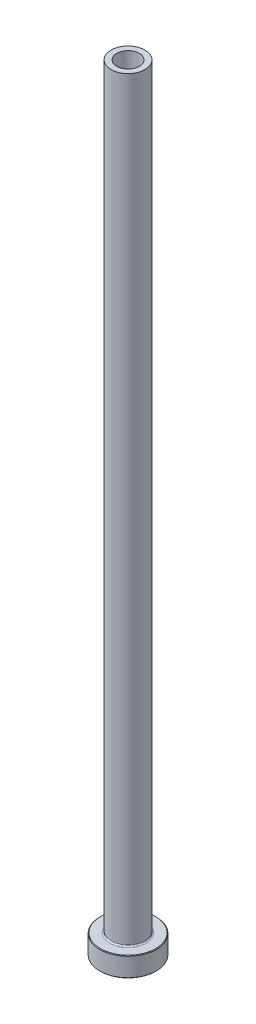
ISO-10303-21;
HEADER;
FILE_DESCRIPTION(('STEP AP214'),'2;1');
FILE_NAME('part.step','',(''),(''),'','','');
FILE_SCHEMA(('AUTOMOTIVE_DESIGN { 1 0 10303 214 1 1 1 1 }'));
ENDSEC;
DATA;
#1=APPLICATION_CONTEXT('core data for automotive mechanical design processes');
#2=APPLICATION_PROTOCOL_DEFINITION('international standard','automotive_design',2000,#1);
#3=PRODUCT_CONTEXT('',#1,'mechanical');
#4=PRODUCT('Part','Part','',(#3));
#5=PRODUCT_RELATED_PRODUCT_CATEGORY('part','',(#4));
#6=PRODUCT_DEFINITION_FORMATION('','',#4);
#7=PRODUCT_DEFINITION_CONTEXT('part definition',#1,'design');
#8=PRODUCT_DEFINITION('design','',#6,#7);
#9=PRODUCT_DEFINITION_SHAPE('','',#8);
#10=(LENGTH_UNIT() NAMED_UNIT(*) SI_UNIT(.MILLI.,.METRE.));
#11=(NAMED_UNIT(*) PLANE_ANGLE_UNIT() SI_UNIT($,.RADIAN.));
#12=(NAMED_UNIT(*) SI_UNIT($,.STERADIAN.) SOLID_ANGLE_UNIT());
#13=UNCERTAINTY_MEASURE_WITH_UNIT(LENGTH_MEASURE(1.E-05),#10,'distance_accuracy_value','');
#14=(GEOMETRIC_REPRESENTATION_CONTEXT(3) GLOBAL_UNCERTAINTY_ASSIGNED_CONTEXT((#13)) GLOBAL_UNIT_ASSIGNED_CONTEXT((#10,
#11,#12)) REPRESENTATION_CONTEXT('',''));
#15=CARTESIAN_POINT('',(0.,0.,0.));
#16=DIRECTION('',(0.,0.,1.));
#17=DIRECTION('',(1.,0.,0.));
#18=AXIS2_PLACEMENT_3D('',#15,#16,#17);
#19=CARTESIAN_POINT('',(0.,92.1876809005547,0.));
#20=DIRECTION('',(0.,1.,0.));
#21=DIRECTION('',(0.,0.,1.));
#22=AXIS2_PLACEMENT_3D('',#19,#20,#21);
#23=CYLINDRICAL_SURFACE('',#22,4.00000000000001);
#24=CARTESIAN_POINT('',(0.,275.,0.));
#25=DIRECTION('',(0.,1.,0.));
#26=DIRECTION('',(0.,0.,1.));
#27=AXIS2_PLACEMENT_3D('',#24,#25,#26);
#28=CIRCLE('',#27,4.00000000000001);
#29=CARTESIAN_POINT('',(0.,275.,4.00000000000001));
#30=VERTEX_POINT('',#29);
#31=EDGE_CURVE('E62',#30,#30,#28,.T.);
#32=ORIENTED_EDGE('',*,*,#31,.T.);
#33=EDGE_LOOP('',(#32));
#34=FACE_BOUND('',#33,.T.);
#35=CARTESIAN_POINT('',(0.,230.,0.));
#36=DIRECTION('',(0.,1.,0.));
#37=DIRECTION('',(0.,0.,1.));
#38=AXIS2_PLACEMENT_3D('',#35,#36,#37);
#39=CIRCLE('',#38,4.00000000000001);
#40=CARTESIAN_POINT('',(0.,230.,4.00000000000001));
#41=VERTEX_POINT('',#40);
#42=EDGE_CURVE('E71',#41,#41,#39,.T.);
#43=ORIENTED_EDGE('',*,*,#42,.F.);
#44=EDGE_LOOP('',(#43));
#45=FACE_BOUND('',#44,.T.);
#46=ADVANCED_FACE('F30',(#34,#45),#23,.F.);
#47=CARTESIAN_POINT('',(-4.00000000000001,275.,0.));
#48=DIRECTION('',(0.,1.,0.));
#49=DIRECTION('',(0.,0.,1.));
#50=AXIS2_PLACEMENT_3D('',#47,#48,#49);
#51=PLANE('',#50);
#52=CARTESIAN_POINT('',(0.,275.,0.));
#53=DIRECTION('',(0.,1.,0.));
#54=DIRECTION('',(0.,0.,1.));
#55=AXIS2_PLACEMENT_3D('',#52,#53,#54);
#56=CIRCLE('',#55,6.00000000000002);
#57=CARTESIAN_POINT('',(0.,275.,6.00000000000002));
#58=VERTEX_POINT('',#57);
#59=EDGE_CURVE('E65',#58,#58,#56,.T.);
#60=ORIENTED_EDGE('',*,*,#59,.T.);
#61=EDGE_LOOP('',(#60));
#62=FACE_BOUND('',#61,.T.);
#63=ORIENTED_EDGE('',*,*,#31,.F.);
#64=EDGE_LOOP('',(#63));
#65=FACE_BOUND('',#64,.T.);
#66=ADVANCED_FACE('F79',(#62,#65),#51,.T.);
#67=CARTESIAN_POINT('',(0.,92.1876809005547,0.));
#68=DIRECTION('',(0.,1.,0.));
#69=DIRECTION('',(0.,0.,1.));
#70=AXIS2_PLACEMENT_3D('',#67,#68,#69);
#71=CYLINDRICAL_SURFACE('',#70,6.00000000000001);
#72=CARTESIAN_POINT('',(0.,7.50000000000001,0.));
#73=DIRECTION('',(0.,1.,0.));
#74=DIRECTION('',(0.,0.,1.));
#75=AXIS2_PLACEMENT_3D('',#72,#73,#74);
#76=CIRCLE('',#75,6.00000000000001);
#77=CARTESIAN_POINT('',(0.,7.50000000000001,6.00000000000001));
#78=VERTEX_POINT('',#77);
#79=EDGE_CURVE('E59',#78,#78,#76,.T.);
#80=ORIENTED_EDGE('',*,*,#79,.T.);
#81=EDGE_LOOP('',(#80));
#82=FACE_BOUND('',#81,.T.);
#83=ORIENTED_EDGE('',*,*,#59,.F.);
#84=EDGE_LOOP('',(#83));
#85=FACE_BOUND('',#84,.T.);
#86=ADVANCED_FACE('F85',(#82,#85),#71,.T.);
#87=CARTESIAN_POINT('',(-5.99999999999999,7.,0.));
#88=DIRECTION('',(0.,1.,0.));
#89=DIRECTION('',(0.,0.,1.));
#90=AXIS2_PLACEMENT_3D('',#87,#88,#89);
#91=PLANE('',#90);
#92=CARTESIAN_POINT('',(0.,7.,0.));
#93=DIRECTION('',(0.,1.,0.));
#94=DIRECTION('',(0.,0.,1.));
#95=AXIS2_PLACEMENT_3D('',#92,#93,#94);
#96=CIRCLE('',#95,9.80000000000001);
#97=CARTESIAN_POINT('',(0.,7.,-9.80000000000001));
#98=VERTEX_POINT('',#97);
#99=EDGE_CURVE('E53',#98,#98,#96,.T.);
#100=ORIENTED_EDGE('',*,*,#99,.T.);
#101=EDGE_LOOP('',(#100));
#102=FACE_BOUND('',#101,.T.);
#103=CARTESIAN_POINT('',(0.,7.,0.));
#104=DIRECTION('',(0.,1.,0.));
#105=DIRECTION('',(0.,0.,1.));
#106=AXIS2_PLACEMENT_3D('',#103,#104,#105);
#107=CIRCLE('',#106,6.50000000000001);
#108=CARTESIAN_POINT('',(0.,7.,6.50000000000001));
#109=VERTEX_POINT('',#108);
#110=EDGE_CURVE('E56',#109,#109,#107,.F.);
#111=ORIENTED_EDGE('',*,*,#110,.T.);
#112=EDGE_LOOP('',(#111));
#113=FACE_BOUND('',#112,.T.);
#114=ADVANCED_FACE('F111',(#102,#113),#91,.T.);
#115=CARTESIAN_POINT('',(0.,92.1876809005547,0.));
#116=DIRECTION('',(0.,1.,0.));
#117=DIRECTION('',(0.,0.,1.));
#118=AXIS2_PLACEMENT_3D('',#115,#116,#117);
#119=CYLINDRICAL_SURFACE('',#118,9.99999999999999);
#120=CARTESIAN_POINT('',(0.,6.80000000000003,0.));
#121=DIRECTION('',(0.,1.,0.));
#122=DIRECTION('',(0.,0.,1.));
#123=AXIS2_PLACEMENT_3D('',#120,#121,#122);
#124=CIRCLE('',#123,9.99999999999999);
#125=CARTESIAN_POINT('',(0.,6.80000000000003,-9.99999999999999));
#126=VERTEX_POINT('',#125);
#127=EDGE_CURVE('E45',#126,#126,#124,.F.);
#128=ORIENTED_EDGE('',*,*,#127,.T.);
#129=EDGE_LOOP('',(#128));
#130=FACE_BOUND('',#129,.T.);
#131=CARTESIAN_POINT('',(0.,0.200000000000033,0.));
#132=DIRECTION('',(0.,-1.,0.));
#133=DIRECTION('',(0.,0.,-1.));
#134=AXIS2_PLACEMENT_3D('',#131,#132,#133);
#135=CIRCLE('',#134,9.99999999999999);
#136=CARTESIAN_POINT('',(0.,0.200000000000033,-9.99999999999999));
#137=VERTEX_POINT('',#136);
#138=EDGE_CURVE('E50',#137,#137,#135,.F.);
#139=ORIENTED_EDGE('',*,*,#138,.T.);
#140=EDGE_LOOP('',(#139));
#141=FACE_BOUND('',#140,.T.);
#142=ADVANCED_FACE('F108',(#130,#141),#119,.T.);
#143=CARTESIAN_POINT('',(-9.99999999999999,0.,0.));
#144=DIRECTION('',(0.,-1.,0.));
#145=DIRECTION('',(0.,0.,-1.));
#146=AXIS2_PLACEMENT_3D('',#143,#144,#145);
#147=PLANE('',#146);
#148=CARTESIAN_POINT('',(0.,0.,0.));
#149=DIRECTION('',(0.,-1.,0.));
#150=DIRECTION('',(0.,0.,-1.));
#151=AXIS2_PLACEMENT_3D('',#148,#149,#150);
#152=CIRCLE('',#151,4.75000000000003);
#153=CARTESIAN_POINT('',(0.,0.,-4.75000000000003));
#154=VERTEX_POINT('',#153);
#155=EDGE_CURVE('E37',#154,#154,#152,.F.);
#156=ORIENTED_EDGE('',*,*,#155,.T.);
#157=EDGE_LOOP('',(#156));
#158=FACE_BOUND('',#157,.T.);
#159=CARTESIAN_POINT('',(0.,0.,0.));
#160=DIRECTION('',(0.,-1.,0.));
#161=DIRECTION('',(0.,0.,-1.));
#162=AXIS2_PLACEMENT_3D('',#159,#160,#161);
#163=CIRCLE('',#162,9.79999999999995);
#164=CARTESIAN_POINT('',(0.,0.,-9.79999999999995));
#165=VERTEX_POINT('',#164);
#166=EDGE_CURVE('E41',#165,#165,#163,.T.);
#167=ORIENTED_EDGE('',*,*,#166,.T.);
#168=EDGE_LOOP('',(#167));
#169=FACE_BOUND('',#168,.T.);
#170=ADVANCED_FACE('F110',(#158,#169),#147,.T.);
#171=CARTESIAN_POINT('',(0.,92.1876809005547,0.));
#172=DIRECTION('',(0.,1.,0.));
#173=DIRECTION('',(0.,0.,1.));
#174=AXIS2_PLACEMENT_3D('',#171,#172,#173);
#175=CYLINDRICAL_SURFACE('',#174,4.25);
#176=CARTESIAN_POINT('',(0.,0.500000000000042,0.));
#177=DIRECTION('',(0.,-1.,0.));
#178=DIRECTION('',(0.,0.,-1.));
#179=AXIS2_PLACEMENT_3D('',#176,#177,#178);
#180=CIRCLE('',#179,4.25);
#181=CARTESIAN_POINT('',(0.,0.500000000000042,-4.25));
#182=VERTEX_POINT('',#181);
#183=EDGE_CURVE('E10',#182,#182,#180,.T.);
#184=ORIENTED_EDGE('',*,*,#183,.T.);
#185=EDGE_LOOP('',(#184));
#186=FACE_BOUND('',#185,.T.);
#187=CARTESIAN_POINT('',(0.,218.,0.));
#188=DIRECTION('',(0.,1.,0.));
#189=DIRECTION('',(0.,0.,1.));
#190=AXIS2_PLACEMENT_3D('',#187,#188,#189);
#191=CIRCLE('',#190,4.25000000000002);
#192=CARTESIAN_POINT('',(0.,218.,4.25000000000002));
#193=VERTEX_POINT('',#192);
#194=EDGE_CURVE('E68',#193,#193,#191,.T.);
#195=ORIENTED_EDGE('',*,*,#194,.T.);
#196=EDGE_LOOP('',(#195));
#197=FACE_BOUND('',#196,.T.);
#198=ADVANCED_FACE('F118',(#186,#197),#175,.F.);
#199=CARTESIAN_POINT('',(0.,218.,0.));
#200=DIRECTION('',(0.,-1.,0.));
#201=DIRECTION('',(0.,0.,-1.));
#202=AXIS2_PLACEMENT_3D('',#199,#200,#201);
#203=CONICAL_SURFACE('',#202,4.25000000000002,0.0208303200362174);
#204=ORIENTED_EDGE('',*,*,#42,.T.);
#205=EDGE_LOOP('',(#204));
#206=FACE_BOUND('',#205,.T.);
#207=ORIENTED_EDGE('',*,*,#194,.F.);
#208=EDGE_LOOP('',(#207));
#209=FACE_BOUND('',#208,.T.);
#210=ADVANCED_FACE('F75',(#206,#209),#203,.F.);
#211=CARTESIAN_POINT('',(0.,7.50000000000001,0.));
#212=DIRECTION('',(0.,1.,0.));
#213=DIRECTION('',(0.,0.,1.));
#214=AXIS2_PLACEMENT_3D('',#211,#212,#213);
#215=TOROIDAL_SURFACE('',#214,6.50000000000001,0.5);
#216=ORIENTED_EDGE('',*,*,#110,.F.);
#217=EDGE_LOOP('',(#216));
#218=FACE_BOUND('',#217,.T.);
#219=ORIENTED_EDGE('',*,*,#79,.F.);
#220=EDGE_LOOP('',(#219));
#221=FACE_BOUND('',#220,.T.);
#222=ADVANCED_FACE('F90',(#218,#221),#215,.F.);
#223=CARTESIAN_POINT('',(0.,7.00000000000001,0.));
#224=DIRECTION('',(0.,-1.,0.));
#225=DIRECTION('',(0.,0.,-1.));
#226=AXIS2_PLACEMENT_3D('',#223,#224,#225);
#227=CONICAL_SURFACE('',#226,9.8,0.785398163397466);
#228=CARTESIAN_POINT('',(0.,6.80000000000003,-9.99999999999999));
#229=CARTESIAN_POINT('',(0.,6.80208333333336,-9.99791666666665));
#230=CARTESIAN_POINT('',(0.,6.80416666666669,-9.99583333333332));
#231=CARTESIAN_POINT('',(0.,6.80833333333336,-9.99166666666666));
#232=CARTESIAN_POINT('',(0.,6.81041666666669,-9.98958333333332));
#233=CARTESIAN_POINT('',(0.,6.81458333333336,-9.98541666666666));
#234=CARTESIAN_POINT('',(0.,6.81666666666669,-9.98333333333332));
#235=CARTESIAN_POINT('',(0.,6.82083333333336,-9.97916666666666));
#236=CARTESIAN_POINT('',(0.,6.82291666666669,-9.97708333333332));
#237=CARTESIAN_POINT('',(0.,6.82708333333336,-9.97291666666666));
#238=CARTESIAN_POINT('',(0.,6.82916666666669,-9.97083333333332));
#239=CARTESIAN_POINT('',(0.,6.83333333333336,-9.96666666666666));
#240=CARTESIAN_POINT('',(0.,6.83541666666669,-9.96458333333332));
#241=CARTESIAN_POINT('',(0.,6.83958333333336,-9.96041666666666));
#242=CARTESIAN_POINT('',(0.,6.84166666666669,-9.95833333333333));
#243=CARTESIAN_POINT('',(0.,6.84583333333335,-9.95416666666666));
#244=CARTESIAN_POINT('',(0.,6.84791666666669,-9.95208333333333));
#245=CARTESIAN_POINT('',(0.,6.85208333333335,-9.94791666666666));
#246=CARTESIAN_POINT('',(0.,6.85416666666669,-9.94583333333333));
#247=CARTESIAN_POINT('',(0.,6.85833333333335,-9.94166666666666));
#248=CARTESIAN_POINT('',(0.,6.86041666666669,-9.93958333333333));
#249=CARTESIAN_POINT('',(0.,6.86458333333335,-9.93541666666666));
#250=CARTESIAN_POINT('',(0.,6.86666666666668,-9.93333333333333));
#251=CARTESIAN_POINT('',(0.,6.87083333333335,-9.92916666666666));
#252=CARTESIAN_POINT('',(0.,6.87291666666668,-9.92708333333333));
#253=CARTESIAN_POINT('',(0.,6.87708333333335,-9.92291666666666));
#254=CARTESIAN_POINT('',(0.,6.87916666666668,-9.92083333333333));
#255=CARTESIAN_POINT('',(0.,6.88333333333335,-9.91666666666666));
#256=CARTESIAN_POINT('',(0.,6.88541666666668,-9.91458333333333));
#257=CARTESIAN_POINT('',(0.,6.88958333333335,-9.91041666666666));
#258=CARTESIAN_POINT('',(0.,6.89166666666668,-9.90833333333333));
#259=CARTESIAN_POINT('',(0.,6.89583333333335,-9.90416666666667));
#260=CARTESIAN_POINT('',(0.,6.89791666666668,-9.90208333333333));
#261=CARTESIAN_POINT('',(0.,6.90208333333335,-9.89791666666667));
#262=CARTESIAN_POINT('',(0.,6.90416666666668,-9.89583333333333));
#263=CARTESIAN_POINT('',(0.,6.90833333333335,-9.89166666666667));
#264=CARTESIAN_POINT('',(0.,6.91041666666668,-9.88958333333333));
#265=CARTESIAN_POINT('',(0.,6.91458333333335,-9.88541666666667));
#266=CARTESIAN_POINT('',(0.,6.91666666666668,-9.88333333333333));
#267=CARTESIAN_POINT('',(0.,6.92083333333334,-9.87916666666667));
#268=CARTESIAN_POINT('',(0.,6.92291666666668,-9.87708333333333));
#269=CARTESIAN_POINT('',(0.,6.92708333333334,-9.87291666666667));
#270=CARTESIAN_POINT('',(0.,6.92916666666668,-9.87083333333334));
#271=CARTESIAN_POINT('',(0.,6.93333333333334,-9.86666666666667));
#272=CARTESIAN_POINT('',(0.,6.93541666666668,-9.86458333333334));
#273=CARTESIAN_POINT('',(0.,6.93958333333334,-9.86041666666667));
#274=CARTESIAN_POINT('',(0.,6.94166666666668,-9.85833333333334));
#275=CARTESIAN_POINT('',(0.,6.94583333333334,-9.85416666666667));
#276=CARTESIAN_POINT('',(0.,6.94791666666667,-9.85208333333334));
#277=CARTESIAN_POINT('',(0.,6.95208333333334,-9.84791666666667));
#278=CARTESIAN_POINT('',(0.,6.95416666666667,-9.84583333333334));
#279=CARTESIAN_POINT('',(0.,6.95833333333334,-9.84166666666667));
#280=CARTESIAN_POINT('',(0.,6.96041666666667,-9.83958333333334));
#281=CARTESIAN_POINT('',(0.,6.96458333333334,-9.83541666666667));
#282=CARTESIAN_POINT('',(0.,6.96666666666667,-9.83333333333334));
#283=CARTESIAN_POINT('',(0.,6.97083333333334,-9.82916666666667));
#284=CARTESIAN_POINT('',(0.,6.97291666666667,-9.82708333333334));
#285=CARTESIAN_POINT('',(0.,6.97708333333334,-9.82291666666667));
#286=CARTESIAN_POINT('',(0.,6.97916666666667,-9.82083333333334));
#287=CARTESIAN_POINT('',(0.,6.98333333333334,-9.81666666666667));
#288=CARTESIAN_POINT('',(0.,6.98541666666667,-9.81458333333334));
#289=CARTESIAN_POINT('',(0.,6.98958333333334,-9.81041666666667));
#290=CARTESIAN_POINT('',(0.,6.99166666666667,-9.80833333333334));
#291=CARTESIAN_POINT('',(0.,6.99583333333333,-9.80416666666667));
#292=CARTESIAN_POINT('',(0.,6.99791666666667,-9.80208333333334));
#293=CARTESIAN_POINT('',(0.,7.,-9.80000000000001));
#294=B_SPLINE_CURVE_WITH_KNOTS('',3,(#228,#229,#230,#231,#232,#233,#234,#235,#236,#237,#238,
#239,#240,#241,#242,#243,#244,#245,#246,#247,#248,#249,#250,#251,#252,#253,#254,#255,#256,#257,
#258,#259,#260,#261,#262,#263,#264,#265,#266,#267,#268,#269,#270,#271,#272,#273,#274,#275,#276,
#277,#278,#279,#280,#281,#282,#283,#284,#285,#286,#287,#288,#289,#290,#291,#292,#293),
.UNSPECIFIED.,.F.,.F.,(4,2,2,2,2,2,2,2,2,2,2,2,2,2,2,2,2,2,2,2,2,2,2,2,2,2,2,2,2,2,2,2,4),(0.,
0.00883883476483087,0.0176776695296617,0.0265165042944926,0.0353553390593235,0.0441941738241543,
0.0530330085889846,0.0618718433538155,0.0707106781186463,0.0795495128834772,0.0883883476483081,
0.0972271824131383,0.106066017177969,0.1149048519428,0.123743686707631,0.132582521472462,
0.141421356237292,0.150260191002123,0.159099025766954,0.167937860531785,0.176776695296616,
0.185615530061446,0.194454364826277,0.203293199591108,0.212132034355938,0.220970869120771,
0.229809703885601,0.238648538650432,0.247487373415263,0.256326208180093,0.265165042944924,
0.274003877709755,0.282842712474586),.UNSPECIFIED.);
#295=EDGE_CURVE('BSEAM93',#126,#98,#294,.T.);
#296=ORIENTED_EDGE('',*,*,#127,.F.);
#297=ORIENTED_EDGE('',*,*,#99,.F.);
#298=ORIENTED_EDGE('',*,*,#295,.T.);
#299=ORIENTED_EDGE('',*,*,#295,.F.);
#300=EDGE_LOOP('',(#296,#298,#297,#299));
#301=FACE_BOUND('',#300,.T.);
#302=ADVANCED_FACE('F93',(#301),#227,.T.);
#303=CARTESIAN_POINT('',(0.,0.200000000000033,0.));
#304=DIRECTION('',(0.,1.,0.));
#305=DIRECTION('',(0.,0.,1.));
#306=AXIS2_PLACEMENT_3D('',#303,#304,#305);
#307=CONICAL_SURFACE('',#306,9.99999999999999,0.785398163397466);
#308=ORIENTED_EDGE('',*,*,#166,.F.);
#309=EDGE_LOOP('',(#308));
#310=FACE_BOUND('',#309,.T.);
#311=ORIENTED_EDGE('',*,*,#138,.F.);
#312=EDGE_LOOP('',(#311));
#313=FACE_BOUND('',#312,.T.);
#314=ADVANCED_FACE('F96',(#310,#313),#307,.T.);
#315=CARTESIAN_POINT('',(0.,0.,0.));
#316=DIRECTION('',(0.,-1.,0.));
#317=DIRECTION('',(0.,0.,-1.));
#318=AXIS2_PLACEMENT_3D('',#315,#316,#317);
#319=CONICAL_SURFACE('',#318,4.75000000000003,0.785398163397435);
#320=ORIENTED_EDGE('',*,*,#183,.F.);
#321=EDGE_LOOP('',(#320));
#322=FACE_BOUND('',#321,.T.);
#323=ORIENTED_EDGE('',*,*,#155,.F.);
#324=EDGE_LOOP('',(#323));
#325=FACE_BOUND('',#324,.T.);
#326=ADVANCED_FACE('F32',(#322,#325),#319,.F.);
#327=CLOSED_SHELL('',(#46,#66,#86,#114,#142,#170,#198,#210,#222,#302,#314,#326));
#328=MANIFOLD_SOLID_BREP('B2',#327);
#329=ADVANCED_BREP_SHAPE_REPRESENTATION('',(#18,#328),#14);
#330=SHAPE_DEFINITION_REPRESENTATION(#9,#329);
ENDSEC;
END-ISO-10303-21;
